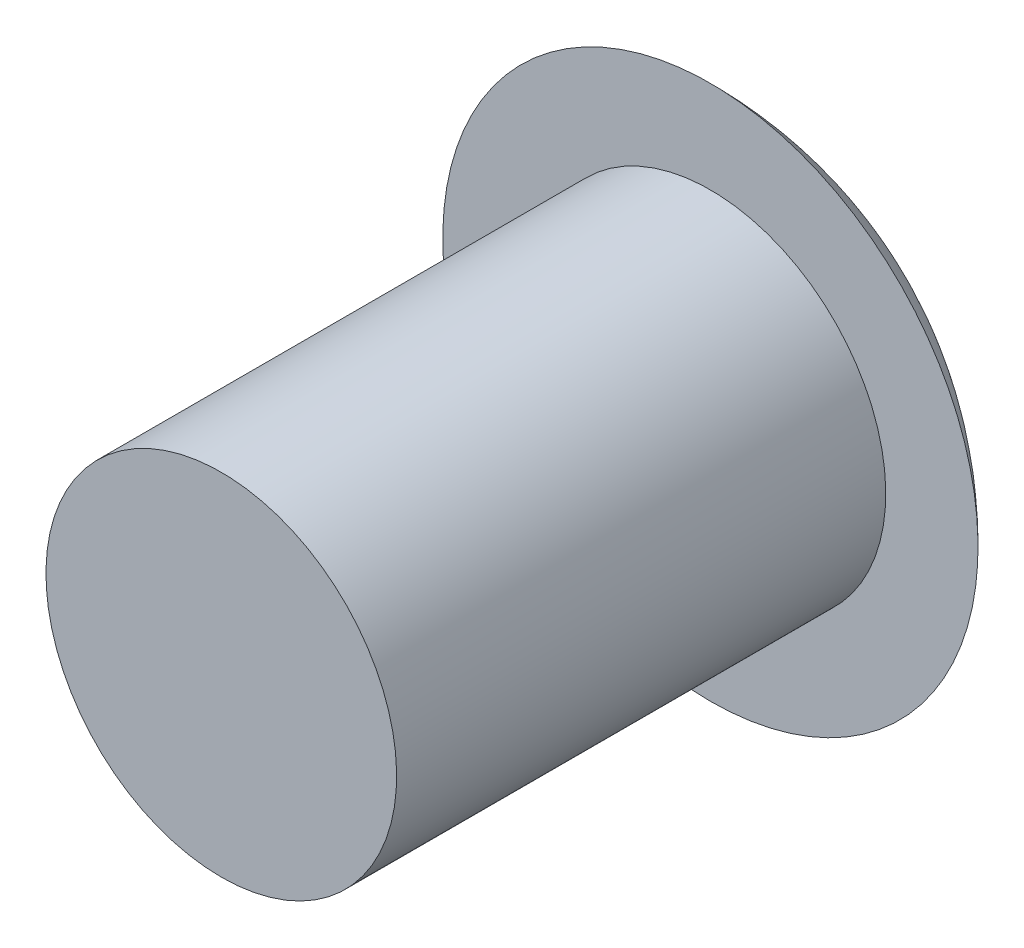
from build123d import *


with BuildPart() as part:
    # Sketch1 → Revolve1 (revolve)
    with BuildSketch(Plane(origin=(0, 0, 0), x_dir=(0, 0, -1), z_dir=(1, 0, 0)), mode=Mode.PRIVATE) as revolve1_sk:
        with BuildLine():
            Line((-3, 0), (3.542640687, 0))
            ThreePointArc((3.542640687, 0), (3.200914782, 1.569805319), (2.3, 2.9))
            Line((2.3, 2.9), (2.3, 1.9))
            Line((2.3, 1.9), (-3, 1.9))
            Line((-3, 1.9), (-3, 0))
        make_face()
    revolve(revolve1_sk.sketch.rotate(Axis((0, 0, 3), (0, 0, -1)), 180), axis=Axis((0, 0, 3), (0, 0, -1)))


solid = part.part
